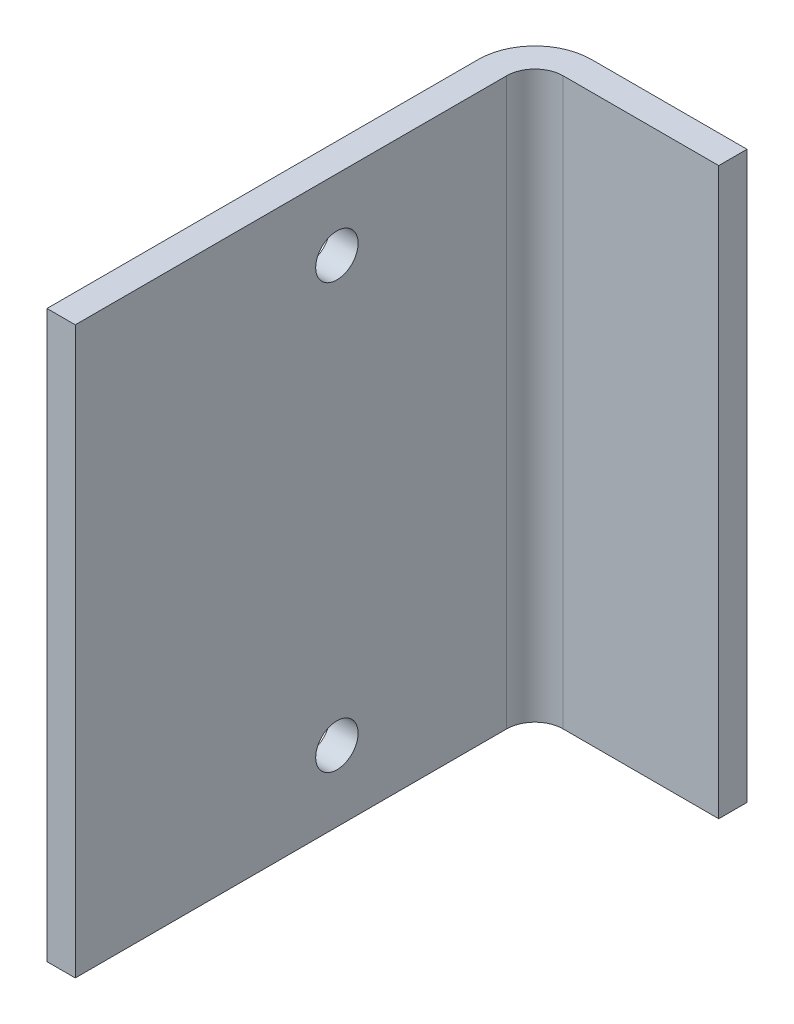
ISO-10303-21;
HEADER;
FILE_DESCRIPTION(('STEP AP214'),'2;1');
FILE_NAME('part.step','',(''),(''),'','','');
FILE_SCHEMA(('AUTOMOTIVE_DESIGN { 1 0 10303 214 1 1 1 1 }'));
ENDSEC;
DATA;
#1=APPLICATION_CONTEXT('core data for automotive mechanical design processes');
#2=APPLICATION_PROTOCOL_DEFINITION('international standard','automotive_design',2000,#1);
#3=PRODUCT_CONTEXT('',#1,'mechanical');
#4=PRODUCT('Part','Part','',(#3));
#5=PRODUCT_RELATED_PRODUCT_CATEGORY('part','',(#4));
#6=PRODUCT_DEFINITION_FORMATION('','',#4);
#7=PRODUCT_DEFINITION_CONTEXT('part definition',#1,'design');
#8=PRODUCT_DEFINITION('design','',#6,#7);
#9=PRODUCT_DEFINITION_SHAPE('','',#8);
#10=(LENGTH_UNIT() NAMED_UNIT(*) SI_UNIT(.MILLI.,.METRE.));
#11=(NAMED_UNIT(*) PLANE_ANGLE_UNIT() SI_UNIT($,.RADIAN.));
#12=(NAMED_UNIT(*) SI_UNIT($,.STERADIAN.) SOLID_ANGLE_UNIT());
#13=UNCERTAINTY_MEASURE_WITH_UNIT(LENGTH_MEASURE(1.E-05),#10,'distance_accuracy_value','');
#14=(GEOMETRIC_REPRESENTATION_CONTEXT(3) GLOBAL_UNCERTAINTY_ASSIGNED_CONTEXT((#13)) GLOBAL_UNIT_ASSIGNED_CONTEXT((#10,
#11,#12)) REPRESENTATION_CONTEXT('',''));
#15=CARTESIAN_POINT('',(0.,0.,0.));
#16=DIRECTION('',(0.,0.,1.));
#17=DIRECTION('',(1.,0.,0.));
#18=AXIS2_PLACEMENT_3D('',#15,#16,#17);
#19=CARTESIAN_POINT('',(30.,-40.,-20.));
#20=DIRECTION('',(1.,0.,0.));
#21=DIRECTION('',(0.,0.,-1.));
#22=AXIS2_PLACEMENT_3D('',#19,#20,#21);
#23=PLANE('',#22);
#24=DIRECTION('',(0.,1.,0.));
#25=VECTOR('',#24,1.);
#26=CARTESIAN_POINT('',(30.,-40.,-20.));
#27=LINE('',#26,#25);
#28=CARTESIAN_POINT('',(30.,-40.,-20.));
#29=VERTEX_POINT('',#28);
#30=CARTESIAN_POINT('',(30.,40.,-20.));
#31=VERTEX_POINT('',#30);
#32=EDGE_CURVE('E79',#29,#31,#27,.T.);
#33=ORIENTED_EDGE('',*,*,#32,.F.);
#34=DIRECTION('',(0.,0.,-1.));
#35=VECTOR('',#34,1.);
#36=CARTESIAN_POINT('',(30.,-40.,20.));
#37=LINE('',#36,#35);
#38=CARTESIAN_POINT('',(30.,-40.,-24.));
#39=VERTEX_POINT('',#38);
#40=EDGE_CURVE('E90',#39,#29,#37,.F.);
#41=ORIENTED_EDGE('',*,*,#40,.F.);
#42=DIRECTION('',(0.,1.,0.));
#43=VECTOR('',#42,1.);
#44=CARTESIAN_POINT('',(30.,-40.,-24.));
#45=LINE('',#44,#43);
#46=CARTESIAN_POINT('',(30.,40.,-24.));
#47=VERTEX_POINT('',#46);
#48=EDGE_CURVE('E96',#47,#39,#45,.F.);
#49=ORIENTED_EDGE('',*,*,#48,.F.);
#50=DIRECTION('',(0.,0.,1.));
#51=VECTOR('',#50,1.);
#52=CARTESIAN_POINT('',(30.,40.,-20.));
#53=LINE('',#52,#51);
#54=EDGE_CURVE('E144',#31,#47,#53,.F.);
#55=ORIENTED_EDGE('',*,*,#54,.F.);
#56=EDGE_LOOP('',(#33,#41,#49,#55));
#57=FACE_BOUND('',#56,.T.);
#58=ADVANCED_FACE('F16',(#57),#23,.T.);
#59=CARTESIAN_POINT('',(0.,-40.,-20.));
#60=DIRECTION('',(0.,0.,1.));
#61=DIRECTION('',(1.,0.,0.));
#62=AXIS2_PLACEMENT_3D('',#59,#60,#61);
#63=PLANE('',#62);
#64=DIRECTION('',(1.,0.,0.));
#65=VECTOR('',#64,1.);
#66=CARTESIAN_POINT('',(0.,40.,-20.));
#67=LINE('',#66,#65);
#68=CARTESIAN_POINT('',(8.,40.,-20.));
#69=VERTEX_POINT('',#68);
#70=EDGE_CURVE('E147',#69,#31,#67,.T.);
#71=ORIENTED_EDGE('',*,*,#70,.F.);
#72=DIRECTION('',(0.,-1.,0.));
#73=VECTOR('',#72,1.);
#74=CARTESIAN_POINT('',(8.,144.288,-20.));
#75=LINE('',#74,#73);
#76=CARTESIAN_POINT('',(8.,-40.,-20.));
#77=VERTEX_POINT('',#76);
#78=EDGE_CURVE('E70',#69,#77,#75,.T.);
#79=ORIENTED_EDGE('',*,*,#78,.T.);
#80=DIRECTION('',(1.,0.,0.));
#81=VECTOR('',#80,1.);
#82=CARTESIAN_POINT('',(0.,-40.,-20.));
#83=LINE('',#82,#81);
#84=EDGE_CURVE('E162',#29,#77,#83,.F.);
#85=ORIENTED_EDGE('',*,*,#84,.F.);
#86=ORIENTED_EDGE('',*,*,#32,.T.);
#87=EDGE_LOOP('',(#71,#79,#85,#86));
#88=FACE_BOUND('',#87,.T.);
#89=ADVANCED_FACE('F203',(#88),#63,.T.);
#90=CARTESIAN_POINT('',(8.,144.288,-16.));
#91=DIRECTION('',(0.,-1.,0.));
#92=DIRECTION('',(0.,0.,-1.));
#93=AXIS2_PLACEMENT_3D('',#90,#91,#92);
#94=CYLINDRICAL_SURFACE('',#93,4.);
#95=ORIENTED_EDGE('',*,*,#78,.F.);
#96=CARTESIAN_POINT('',(8.,40.,-16.));
#97=DIRECTION('',(0.,-1.,0.));
#98=DIRECTION('',(0.,0.,-1.));
#99=AXIS2_PLACEMENT_3D('',#96,#97,#98);
#100=CIRCLE('',#99,4.);
#101=CARTESIAN_POINT('',(4.,40.,-16.));
#102=VERTEX_POINT('',#101);
#103=EDGE_CURVE('E19',#102,#69,#100,.T.);
#104=ORIENTED_EDGE('',*,*,#103,.F.);
#105=DIRECTION('',(0.,1.,0.));
#106=VECTOR('',#105,1.);
#107=CARTESIAN_POINT('',(4.,0.,-16.));
#108=LINE('',#107,#106);
#109=CARTESIAN_POINT('',(4.,-40.,-16.));
#110=VERTEX_POINT('',#109);
#111=EDGE_CURVE('E62',#110,#102,#108,.T.);
#112=ORIENTED_EDGE('',*,*,#111,.F.);
#113=CARTESIAN_POINT('',(8.,-40.,-16.));
#114=DIRECTION('',(0.,-1.,0.));
#115=DIRECTION('',(0.,0.,-1.));
#116=AXIS2_PLACEMENT_3D('',#113,#114,#115);
#117=CIRCLE('',#116,4.);
#118=EDGE_CURVE('E178',#77,#110,#117,.F.);
#119=ORIENTED_EDGE('',*,*,#118,.F.);
#120=EDGE_LOOP('',(#95,#104,#112,#119));
#121=FACE_BOUND('',#120,.T.);
#122=ADVANCED_FACE('F200',(#121),#94,.F.);
#123=CARTESIAN_POINT('',(30.,-40.,-24.));
#124=DIRECTION('',(0.,0.,-1.));
#125=DIRECTION('',(-1.,0.,0.));
#126=AXIS2_PLACEMENT_3D('',#123,#124,#125);
#127=PLANE('',#126);
#128=DIRECTION('',(1.,0.,0.));
#129=VECTOR('',#128,1.);
#130=CARTESIAN_POINT('',(0.,-40.,-24.));
#131=LINE('',#130,#129);
#132=CARTESIAN_POINT('',(8.,-40.,-24.));
#133=VERTEX_POINT('',#132);
#134=EDGE_CURVE('E115',#133,#39,#131,.T.);
#135=ORIENTED_EDGE('',*,*,#134,.F.);
#136=DIRECTION('',(0.,-1.,0.));
#137=VECTOR('',#136,1.);
#138=CARTESIAN_POINT('',(8.,144.288,-24.));
#139=LINE('',#138,#137);
#140=CARTESIAN_POINT('',(8.,40.,-24.));
#141=VERTEX_POINT('',#140);
#142=EDGE_CURVE('E151',#141,#133,#139,.T.);
#143=ORIENTED_EDGE('',*,*,#142,.F.);
#144=DIRECTION('',(1.,0.,0.));
#145=VECTOR('',#144,1.);
#146=CARTESIAN_POINT('',(0.,40.,-24.));
#147=LINE('',#146,#145);
#148=EDGE_CURVE('E140',#47,#141,#147,.F.);
#149=ORIENTED_EDGE('',*,*,#148,.F.);
#150=ORIENTED_EDGE('',*,*,#48,.T.);
#151=EDGE_LOOP('',(#135,#143,#149,#150));
#152=FACE_BOUND('',#151,.T.);
#153=ADVANCED_FACE('F202',(#152),#127,.T.);
#154=CARTESIAN_POINT('',(4.,0.,0.));
#155=DIRECTION('',(1.,0.,0.));
#156=DIRECTION('',(0.,0.,-1.));
#157=AXIS2_PLACEMENT_3D('',#154,#155,#156);
#158=PLANE('',#157);
#159=CARTESIAN_POINT('',(4.,-30.,8.));
#160=DIRECTION('',(-1.,0.,0.));
#161=DIRECTION('',(0.,0.,1.));
#162=AXIS2_PLACEMENT_3D('',#159,#160,#161);
#163=CIRCLE('',#162,3.);
#164=CARTESIAN_POINT('',(4.,-30.,11.));
#165=VERTEX_POINT('',#164);
#166=EDGE_CURVE('E128',#165,#165,#163,.T.);
#167=ORIENTED_EDGE('',*,*,#166,.T.);
#168=EDGE_LOOP('',(#167));
#169=FACE_BOUND('',#168,.T.);
#170=CARTESIAN_POINT('',(4.,30.,8.));
#171=DIRECTION('',(-1.,0.,0.));
#172=DIRECTION('',(0.,0.,1.));
#173=AXIS2_PLACEMENT_3D('',#170,#171,#172);
#174=CIRCLE('',#173,3.);
#175=CARTESIAN_POINT('',(4.,30.,11.));
#176=VERTEX_POINT('',#175);
#177=EDGE_CURVE('E131',#176,#176,#174,.T.);
#178=ORIENTED_EDGE('',*,*,#177,.T.);
#179=EDGE_LOOP('',(#178));
#180=FACE_BOUND('',#179,.T.);
#181=DIRECTION('',(0.,1.,0.));
#182=VECTOR('',#181,1.);
#183=CARTESIAN_POINT('',(4.,0.,45.));
#184=LINE('',#183,#182);
#185=CARTESIAN_POINT('',(4.,-40.,45.));
#186=VERTEX_POINT('',#185);
#187=CARTESIAN_POINT('',(4.,40.,45.));
#188=VERTEX_POINT('',#187);
#189=EDGE_CURVE('E112',#186,#188,#184,.T.);
#190=ORIENTED_EDGE('',*,*,#189,.F.);
#191=DIRECTION('',(0.,0.,-1.));
#192=VECTOR('',#191,1.);
#193=CARTESIAN_POINT('',(4.,-40.,20.));
#194=LINE('',#193,#192);
#195=EDGE_CURVE('E179',#110,#186,#194,.F.);
#196=ORIENTED_EDGE('',*,*,#195,.F.);
#197=ORIENTED_EDGE('',*,*,#111,.T.);
#198=DIRECTION('',(0.,0.,1.));
#199=VECTOR('',#198,1.);
#200=CARTESIAN_POINT('',(4.,40.,-20.));
#201=LINE('',#200,#199);
#202=EDGE_CURVE('E138',#188,#102,#201,.F.);
#203=ORIENTED_EDGE('',*,*,#202,.F.);
#204=EDGE_LOOP('',(#190,#196,#197,#203));
#205=FACE_BOUND('',#204,.T.);
#206=ADVANCED_FACE('F199',(#169,#180,#205),#158,.T.);
#207=CARTESIAN_POINT('',(0.,40.,-20.));
#208=DIRECTION('',(0.,1.,0.));
#209=DIRECTION('',(0.,0.,1.));
#210=AXIS2_PLACEMENT_3D('',#207,#208,#209);
#211=PLANE('',#210);
#212=DIRECTION('',(1.,0.,0.));
#213=VECTOR('',#212,1.);
#214=CARTESIAN_POINT('',(0.,40.,45.));
#215=LINE('',#214,#213);
#216=CARTESIAN_POINT('',(0.,40.,45.));
#217=VERTEX_POINT('',#216);
#218=EDGE_CURVE('E106',#188,#217,#215,.F.);
#219=ORIENTED_EDGE('',*,*,#218,.F.);
#220=ORIENTED_EDGE('',*,*,#202,.T.);
#221=ORIENTED_EDGE('',*,*,#103,.T.);
#222=ORIENTED_EDGE('',*,*,#70,.T.);
#223=ORIENTED_EDGE('',*,*,#54,.T.);
#224=ORIENTED_EDGE('',*,*,#148,.T.);
#225=CARTESIAN_POINT('',(8.,40.,-16.));
#226=DIRECTION('',(0.,-1.,0.));
#227=DIRECTION('',(0.,0.,-1.));
#228=AXIS2_PLACEMENT_3D('',#225,#226,#227);
#229=CIRCLE('',#228,8.);
#230=CARTESIAN_POINT('',(0.,40.,-16.));
#231=VERTEX_POINT('',#230);
#232=EDGE_CURVE('E127',#231,#141,#229,.T.);
#233=ORIENTED_EDGE('',*,*,#232,.F.);
#234=DIRECTION('',(0.,0.,-1.));
#235=VECTOR('',#234,1.);
#236=CARTESIAN_POINT('',(0.,40.,0.));
#237=LINE('',#236,#235);
#238=EDGE_CURVE('E120',#231,#217,#237,.F.);
#239=ORIENTED_EDGE('',*,*,#238,.T.);
#240=EDGE_LOOP('',(#219,#220,#221,#222,#223,#224,#233,#239));
#241=FACE_BOUND('',#240,.T.);
#242=ADVANCED_FACE('F125',(#241),#211,.T.);
#243=CARTESIAN_POINT('',(0.,0.,45.));
#244=DIRECTION('',(0.,0.,1.));
#245=DIRECTION('',(1.,0.,0.));
#246=AXIS2_PLACEMENT_3D('',#243,#244,#245);
#247=PLANE('',#246);
#248=ORIENTED_EDGE('',*,*,#218,.T.);
#249=DIRECTION('',(0.,1.,0.));
#250=VECTOR('',#249,1.);
#251=CARTESIAN_POINT('',(0.,0.,45.));
#252=LINE('',#251,#250);
#253=CARTESIAN_POINT('',(0.,-40.,45.));
#254=VERTEX_POINT('',#253);
#255=EDGE_CURVE('E110',#217,#254,#252,.F.);
#256=ORIENTED_EDGE('',*,*,#255,.T.);
#257=DIRECTION('',(1.,0.,0.));
#258=VECTOR('',#257,1.);
#259=CARTESIAN_POINT('',(0.,-40.,45.));
#260=LINE('',#259,#258);
#261=EDGE_CURVE('E177',#186,#254,#260,.F.);
#262=ORIENTED_EDGE('',*,*,#261,.F.);
#263=ORIENTED_EDGE('',*,*,#189,.T.);
#264=EDGE_LOOP('',(#248,#256,#262,#263));
#265=FACE_BOUND('',#264,.T.);
#266=ADVANCED_FACE('F108',(#265),#247,.T.);
#267=CARTESIAN_POINT('',(0.,-40.,20.));
#268=DIRECTION('',(0.,-1.,0.));
#269=DIRECTION('',(0.,0.,-1.));
#270=AXIS2_PLACEMENT_3D('',#267,#268,#269);
#271=PLANE('',#270);
#272=ORIENTED_EDGE('',*,*,#261,.T.);
#273=DIRECTION('',(0.,0.,-1.));
#274=VECTOR('',#273,1.);
#275=CARTESIAN_POINT('',(0.,-40.,0.));
#276=LINE('',#275,#274);
#277=CARTESIAN_POINT('',(0.,-40.,-16.));
#278=VERTEX_POINT('',#277);
#279=EDGE_CURVE('E123',#254,#278,#276,.T.);
#280=ORIENTED_EDGE('',*,*,#279,.T.);
#281=CARTESIAN_POINT('',(8.,-40.,-16.));
#282=DIRECTION('',(0.,-1.,0.));
#283=DIRECTION('',(0.,0.,-1.));
#284=AXIS2_PLACEMENT_3D('',#281,#282,#283);
#285=CIRCLE('',#284,8.);
#286=EDGE_CURVE('E34',#133,#278,#285,.F.);
#287=ORIENTED_EDGE('',*,*,#286,.F.);
#288=ORIENTED_EDGE('',*,*,#134,.T.);
#289=ORIENTED_EDGE('',*,*,#40,.T.);
#290=ORIENTED_EDGE('',*,*,#84,.T.);
#291=ORIENTED_EDGE('',*,*,#118,.T.);
#292=ORIENTED_EDGE('',*,*,#195,.T.);
#293=EDGE_LOOP('',(#272,#280,#287,#288,#289,#290,#291,#292));
#294=FACE_BOUND('',#293,.T.);
#295=ADVANCED_FACE('F198',(#294),#271,.T.);
#296=CARTESIAN_POINT('',(8.,144.288,-16.));
#297=DIRECTION('',(0.,-1.,0.));
#298=DIRECTION('',(0.,0.,-1.));
#299=AXIS2_PLACEMENT_3D('',#296,#297,#298);
#300=CYLINDRICAL_SURFACE('',#299,8.);
#301=ORIENTED_EDGE('',*,*,#142,.T.);
#302=ORIENTED_EDGE('',*,*,#286,.T.);
#303=DIRECTION('',(0.,1.,0.));
#304=VECTOR('',#303,1.);
#305=CARTESIAN_POINT('',(0.,0.,-16.));
#306=LINE('',#305,#304);
#307=EDGE_CURVE('E172',#278,#231,#306,.T.);
#308=ORIENTED_EDGE('',*,*,#307,.T.);
#309=ORIENTED_EDGE('',*,*,#232,.T.);
#310=EDGE_LOOP('',(#301,#302,#308,#309));
#311=FACE_BOUND('',#310,.T.);
#312=ADVANCED_FACE('F228',(#311),#300,.T.);
#313=CARTESIAN_POINT('',(0.,30.,8.));
#314=DIRECTION('',(-1.,0.,0.));
#315=DIRECTION('',(0.,0.,1.));
#316=AXIS2_PLACEMENT_3D('',#313,#314,#315);
#317=CYLINDRICAL_SURFACE('',#316,3.);
#318=ORIENTED_EDGE('',*,*,#177,.F.);
#319=EDGE_LOOP('',(#318));
#320=FACE_BOUND('',#319,.T.);
#321=CARTESIAN_POINT('',(0.,30.,8.));
#322=DIRECTION('',(-1.,0.,0.));
#323=DIRECTION('',(0.,0.,1.));
#324=AXIS2_PLACEMENT_3D('',#321,#322,#323);
#325=CIRCLE('',#324,3.);
#326=CARTESIAN_POINT('',(0.,30.,11.));
#327=VERTEX_POINT('',#326);
#328=EDGE_CURVE('E25',#327,#327,#325,.T.);
#329=ORIENTED_EDGE('',*,*,#328,.T.);
#330=EDGE_LOOP('',(#329));
#331=FACE_BOUND('',#330,.T.);
#332=ADVANCED_FACE('F220',(#320,#331),#317,.F.);
#333=CARTESIAN_POINT('',(0.,-30.,8.));
#334=DIRECTION('',(-1.,0.,0.));
#335=DIRECTION('',(0.,0.,1.));
#336=AXIS2_PLACEMENT_3D('',#333,#334,#335);
#337=CYLINDRICAL_SURFACE('',#336,3.);
#338=ORIENTED_EDGE('',*,*,#166,.F.);
#339=EDGE_LOOP('',(#338));
#340=FACE_BOUND('',#339,.T.);
#341=CARTESIAN_POINT('',(0.,-30.,8.));
#342=DIRECTION('',(-1.,0.,0.));
#343=DIRECTION('',(0.,0.,1.));
#344=AXIS2_PLACEMENT_3D('',#341,#342,#343);
#345=CIRCLE('',#344,3.);
#346=CARTESIAN_POINT('',(0.,-30.,11.));
#347=VERTEX_POINT('',#346);
#348=EDGE_CURVE('E11',#347,#347,#345,.T.);
#349=ORIENTED_EDGE('',*,*,#348,.T.);
#350=EDGE_LOOP('',(#349));
#351=FACE_BOUND('',#350,.T.);
#352=ADVANCED_FACE('F213',(#340,#351),#337,.F.);
#353=CARTESIAN_POINT('',(0.,0.,0.));
#354=DIRECTION('',(1.,0.,0.));
#355=DIRECTION('',(0.,0.,-1.));
#356=AXIS2_PLACEMENT_3D('',#353,#354,#355);
#357=PLANE('',#356);
#358=ORIENTED_EDGE('',*,*,#348,.F.);
#359=EDGE_LOOP('',(#358));
#360=FACE_BOUND('',#359,.T.);
#361=ORIENTED_EDGE('',*,*,#328,.F.);
#362=EDGE_LOOP('',(#361));
#363=FACE_BOUND('',#362,.T.);
#364=ORIENTED_EDGE('',*,*,#279,.F.);
#365=ORIENTED_EDGE('',*,*,#255,.F.);
#366=ORIENTED_EDGE('',*,*,#238,.F.);
#367=ORIENTED_EDGE('',*,*,#307,.F.);
#368=EDGE_LOOP('',(#364,#365,#366,#367));
#369=FACE_BOUND('',#368,.T.);
#370=ADVANCED_FACE('F119',(#360,#363,#369),#357,.F.);
#371=CLOSED_SHELL('',(#58,#89,#122,#153,#206,#242,#266,#295,#312,#332,#352,#370));
#372=MANIFOLD_SOLID_BREP('B1',#371);
#373=ADVANCED_BREP_SHAPE_REPRESENTATION('',(#18,#372),#14);
#374=SHAPE_DEFINITION_REPRESENTATION(#9,#373);
ENDSEC;
END-ISO-10303-21;
